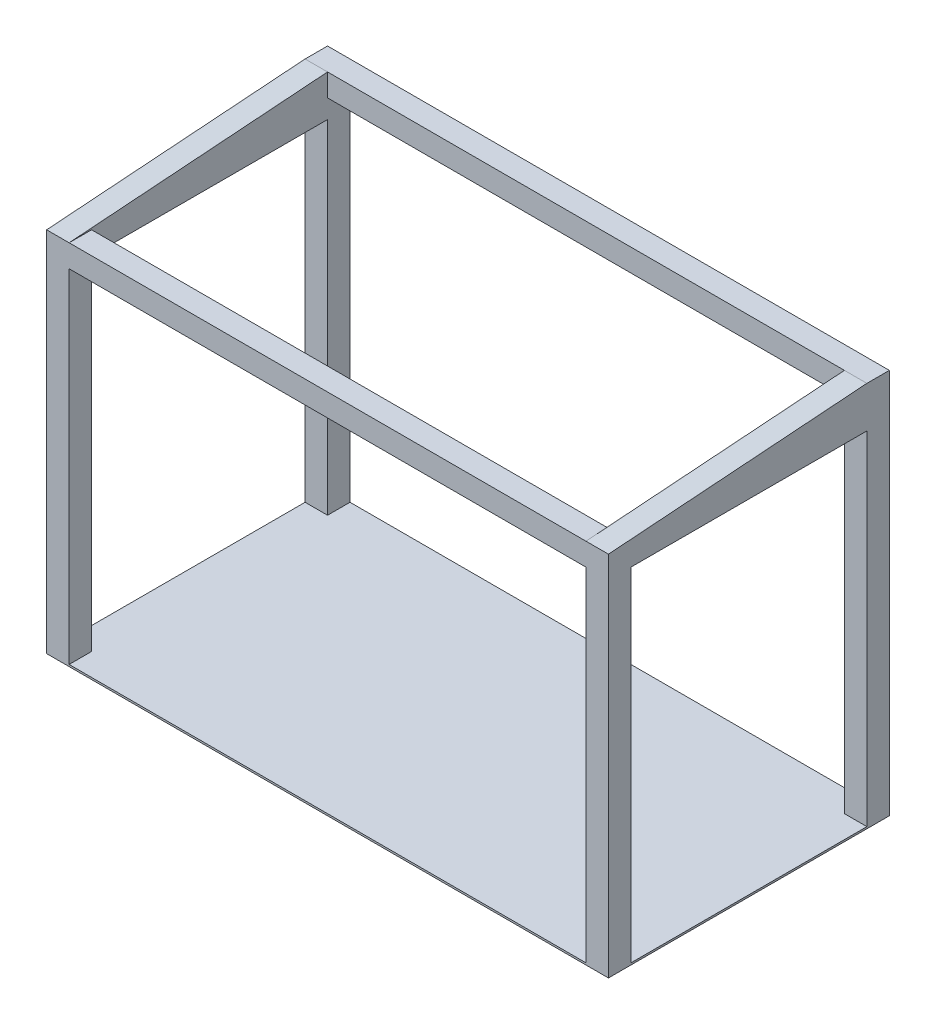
from build123d import *

# Parameters (mm, degrees)
ESQUISSE1_W        = 3000
ESQUISSE1_H        = 1500
BOSS_EXTRU_1_DEPTH = 10
ESQUISSE2_W        = 120
ESQUISSE2_H        = 120
BOSS_EXTRU_2_DEPTH = 1950
ESQUISSE3_W        = 120
ESQUISSE3_H        = 120
BOSS_EXTRU_3_DEPTH = 1260
ESQUISSE4_W        = 120
ESQUISSE4_H        = 120
BOSS_EXTRU_5_DEPTH = 2760
ESQUISSE6_W        = 120
ESQUISSE6_H        = 120
BOSS_EXTRU_6_DEPTH = 100
BOSS_EXTRU_7_DEPTH = 120
BOSS_EXTRU_8_DEPTH = 120
ESQUISSE9_W        = 120
ESQUISSE9_H        = 120
BOSS_EXTRU_9_DEPTH = 2760


with BuildPart() as part:
    # Esquisse1 → Boss.-Extru.1 (new body)
    with BuildSketch(Plane(origin=(0, 0, 0), x_dir=(1, 0, 0), z_dir=(0, 1, 0))):
        Rectangle(ESQUISSE1_W, ESQUISSE1_H)
    extrude(amount=BOSS_EXTRU_1_DEPTH)

    # Esquisse2 → Boss.-Extru.2 (add)
    with BuildSketch(Plane(origin=(0, 10, 0), x_dir=(1, 0, 0), z_dir=(0, 1, 0))):
        with Locations((-1440, 690)):
            Rectangle(ESQUISSE2_W, ESQUISSE2_H)
        with Locations((1440, 690)):
            Rectangle(ESQUISSE2_W, ESQUISSE2_H)
        with Locations((1440, -690)):
            Rectangle(ESQUISSE2_W, ESQUISSE2_H)
        with Locations((-1440, -690)):
            Rectangle(ESQUISSE2_W, ESQUISSE2_H)
    extrude(amount=BOSS_EXTRU_2_DEPTH)

    # Esquisse3 → Boss.-Extru.3 (add)
    with BuildSketch(Plane.XY.offset(-630)):
        with Locations((-1440, 1900)):
            Rectangle(ESQUISSE3_W, ESQUISSE3_H)
        with Locations((1440, 1900)):
            Rectangle(ESQUISSE3_W, ESQUISSE3_H)
    extrude(amount=BOSS_EXTRU_3_DEPTH)

    # Esquisse4 → Boss.-Extru.5 (add)
    with BuildSketch(Plane(origin=(-1380, 0, 0), x_dir=(0, 0, -1), z_dir=(1, 0, 0))):
        with Locations((-690, 1900)):
            Rectangle(ESQUISSE4_W, ESQUISSE4_H)
    extrude(amount=BOSS_EXTRU_5_DEPTH)

    # Esquisse6 → Boss.-Extru.6 (add)
    with BuildSketch(Plane(origin=(0, 1960, 0), x_dir=(1, 0, 0), z_dir=(0, 1, 0))):
        with Locations((1440, 690)):
            Rectangle(ESQUISSE6_W, ESQUISSE6_H)
        with Locations((-1440, 690)):
            Rectangle(ESQUISSE6_W, ESQUISSE6_H)
    extrude(amount=BOSS_EXTRU_6_DEPTH)

    # Esquisse7 → Boss.-Extru.7 (add)
    with BuildSketch(Plane.ZY.offset(1500)):
        Polygon((-630, 2060), (-630, 1960), (750, 1960), align=None)
    extrude(amount=-BOSS_EXTRU_7_DEPTH)

    # Esquisse8 → Boss.-Extru.8 (add)
    with BuildSketch(Plane(origin=(1500, 0, 0), x_dir=(0, 0, -1), z_dir=(1, 0, 0))):
        Polygon((630, 2060), (630, 1960), (-750, 1960), align=None)
    extrude(amount=-BOSS_EXTRU_8_DEPTH)

    # Esquisse9 → Boss.-Extru.9 (add)
    with BuildSketch(Plane.ZY.offset(-1380)):
        with Locations((-690, 2000)):
            Rectangle(ESQUISSE9_W, ESQUISSE9_H)
    extrude(amount=BOSS_EXTRU_9_DEPTH)


solid = part.part
